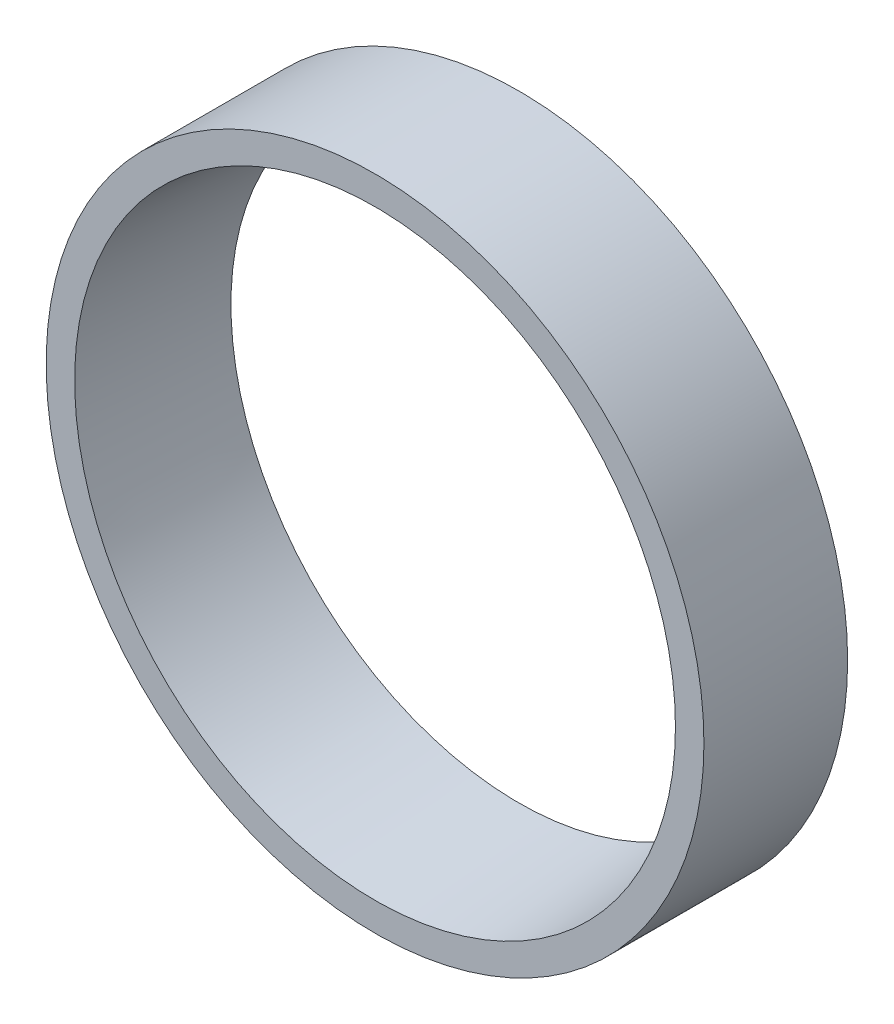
from build123d import *

# Parameters (mm, degrees)
ESQUISSE1_R        = 80.1
ESQUISSE1_R_2      = 70.1
BOSS_EXTRU_1_DEPTH = 35
D_POUILLE1_ANGLE   = -5


with BuildPart() as part:
    # Esquisse1 → Boss.-Extru.1 (new body)
    with BuildSketch(Plane.XY.offset(-154.8112998)):
        Circle(ESQUISSE1_R)
        Circle(ESQUISSE1_R_2, mode=Mode.SUBTRACT)
    extrude(amount=-BOSS_EXTRU_1_DEPTH)

    # D_pouille1
    d_pouille1_faces = [part.faces().sort_by_distance(p)[0] for p in [
        (-70.1, 0, -172.3112998),
    ]]
    draft(d_pouille1_faces, Plane(origin=(0, 0, -189.8112998), x_dir=(-1, 0, 0), z_dir=(0, 0, -1)), D_POUILLE1_ANGLE)


solid = part.part
